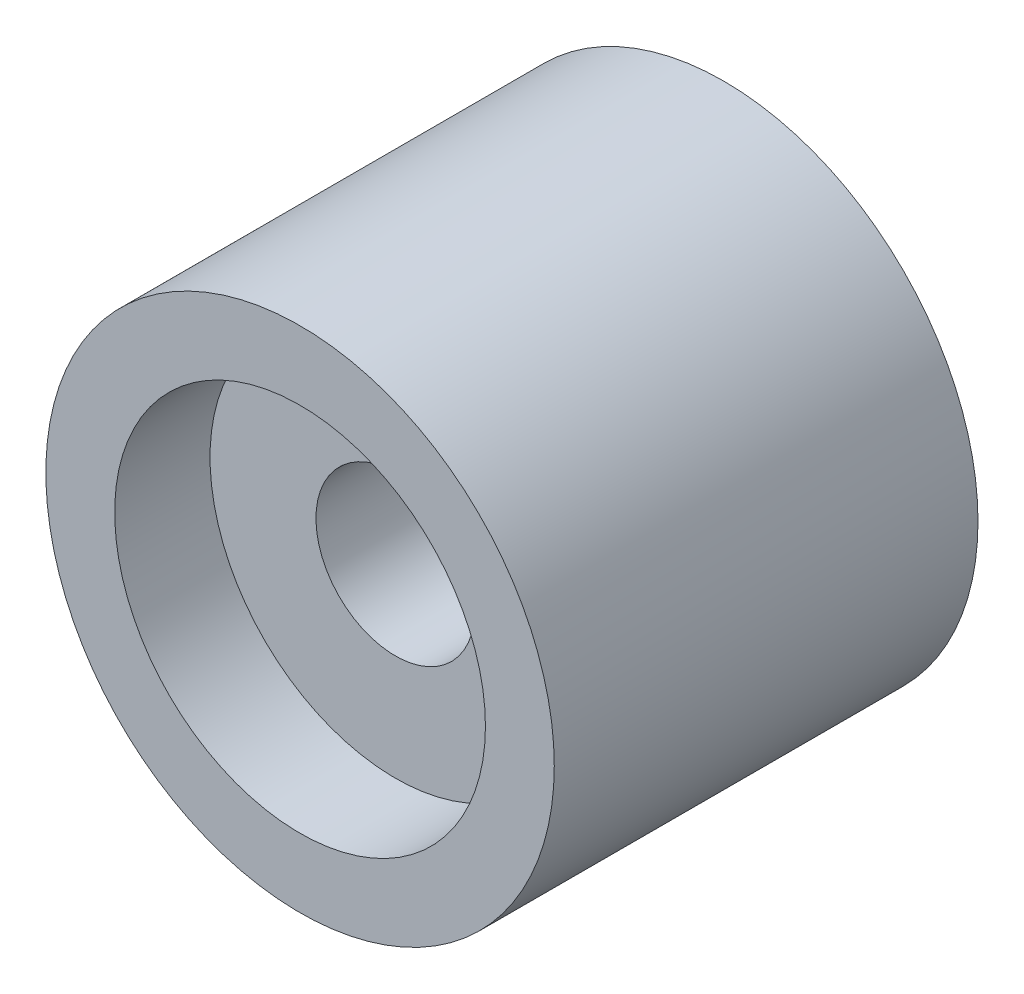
ISO-10303-21;
HEADER;
FILE_DESCRIPTION(('STEP AP214'),'2;1');
FILE_NAME('part.step','',(''),(''),'','','');
FILE_SCHEMA(('AUTOMOTIVE_DESIGN { 1 0 10303 214 1 1 1 1 }'));
ENDSEC;
DATA;
#1=APPLICATION_CONTEXT('core data for automotive mechanical design processes');
#2=APPLICATION_PROTOCOL_DEFINITION('international standard','automotive_design',2000,#1);
#3=PRODUCT_CONTEXT('',#1,'mechanical');
#4=PRODUCT('Part','Part','',(#3));
#5=PRODUCT_RELATED_PRODUCT_CATEGORY('part','',(#4));
#6=PRODUCT_DEFINITION_FORMATION('','',#4);
#7=PRODUCT_DEFINITION_CONTEXT('part definition',#1,'design');
#8=PRODUCT_DEFINITION('design','',#6,#7);
#9=PRODUCT_DEFINITION_SHAPE('','',#8);
#10=(LENGTH_UNIT() NAMED_UNIT(*) SI_UNIT(.MILLI.,.METRE.));
#11=(NAMED_UNIT(*) PLANE_ANGLE_UNIT() SI_UNIT($,.RADIAN.));
#12=(NAMED_UNIT(*) SI_UNIT($,.STERADIAN.) SOLID_ANGLE_UNIT());
#13=UNCERTAINTY_MEASURE_WITH_UNIT(LENGTH_MEASURE(1.E-05),#10,'distance_accuracy_value','');
#14=(GEOMETRIC_REPRESENTATION_CONTEXT(3) GLOBAL_UNCERTAINTY_ASSIGNED_CONTEXT((#13)) GLOBAL_UNIT_ASSIGNED_CONTEXT((#10,
#11,#12)) REPRESENTATION_CONTEXT('',''));
#15=CARTESIAN_POINT('',(0.,0.,0.));
#16=DIRECTION('',(0.,0.,1.));
#17=DIRECTION('',(1.,0.,0.));
#18=AXIS2_PLACEMENT_3D('',#15,#16,#17);
#19=CARTESIAN_POINT('',(0.,-14.999999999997,11.));
#20=DIRECTION('',(0.,0.,-1.));
#21=DIRECTION('',(0.,-1.,0.));
#22=AXIS2_PLACEMENT_3D('',#19,#20,#21);
#23=PLANE('',#22);
#24=CARTESIAN_POINT('',(0.,0.,11.));
#25=DIRECTION('',(0.,0.,1.));
#26=DIRECTION('',(0.,1.,0.));
#27=AXIS2_PLACEMENT_3D('',#24,#25,#26);
#28=CIRCLE('',#27,7.49999999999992);
#29=CARTESIAN_POINT('',(0.,7.49999999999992,11.));
#30=VERTEX_POINT('',#29);
#31=EDGE_CURVE('E8',#30,#30,#28,.T.);
#32=ORIENTED_EDGE('',*,*,#31,.F.);
#33=EDGE_LOOP('',(#32));
#34=FACE_BOUND('',#33,.T.);
#35=CARTESIAN_POINT('',(0.,0.,11.));
#36=DIRECTION('',(0.,0.,1.));
#37=DIRECTION('',(1.,0.,0.));
#38=AXIS2_PLACEMENT_3D('',#35,#36,#37);
#39=CIRCLE('',#38,17.499999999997);
#40=CARTESIAN_POINT('',(17.499999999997,0.,11.));
#41=VERTEX_POINT('',#40);
#42=EDGE_CURVE('E26',#41,#41,#39,.T.);
#43=ORIENTED_EDGE('',*,*,#42,.T.);
#44=EDGE_LOOP('',(#43));
#45=FACE_BOUND('',#44,.T.);
#46=ADVANCED_FACE('F12',(#34,#45),#23,.F.);
#47=CARTESIAN_POINT('',(0.,0.,22.));
#48=DIRECTION('',(0.,0.,1.));
#49=DIRECTION('',(0.,1.,0.));
#50=AXIS2_PLACEMENT_3D('',#47,#48,#49);
#51=CYLINDRICAL_SURFACE('',#50,7.49999999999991);
#52=CARTESIAN_POINT('',(0.,0.,-11.));
#53=DIRECTION('',(0.,0.,1.));
#54=DIRECTION('',(0.,1.,0.));
#55=AXIS2_PLACEMENT_3D('',#52,#53,#54);
#56=CIRCLE('',#55,7.4999999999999);
#57=CARTESIAN_POINT('',(0.,7.49999999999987,-11.));
#58=VERTEX_POINT('',#57);
#59=EDGE_CURVE('E18',#58,#58,#56,.T.);
#60=ORIENTED_EDGE('',*,*,#59,.F.);
#61=EDGE_LOOP('',(#60));
#62=FACE_BOUND('',#61,.T.);
#63=ORIENTED_EDGE('',*,*,#31,.T.);
#64=EDGE_LOOP('',(#63));
#65=FACE_BOUND('',#64,.T.);
#66=ADVANCED_FACE('F59',(#62,#65),#51,.F.);
#67=CARTESIAN_POINT('',(0.,-14.,-11.));
#68=DIRECTION('',(0.,0.,1.));
#69=DIRECTION('',(0.,1.,0.));
#70=AXIS2_PLACEMENT_3D('',#67,#68,#69);
#71=PLANE('',#70);
#72=CARTESIAN_POINT('',(0.,0.,-11.));
#73=DIRECTION('',(0.,0.,1.));
#74=DIRECTION('',(0.,1.,0.));
#75=AXIS2_PLACEMENT_3D('',#72,#73,#74);
#76=CIRCLE('',#75,14.);
#77=CARTESIAN_POINT('',(0.,14.,-11.));
#78=VERTEX_POINT('',#77);
#79=EDGE_CURVE('E22',#78,#78,#76,.T.);
#80=ORIENTED_EDGE('',*,*,#79,.F.);
#81=EDGE_LOOP('',(#80));
#82=FACE_BOUND('',#81,.T.);
#83=ORIENTED_EDGE('',*,*,#59,.T.);
#84=EDGE_LOOP('',(#83));
#85=FACE_BOUND('',#84,.T.);
#86=ADVANCED_FACE('F64',(#82,#85),#71,.F.);
#87=CARTESIAN_POINT('',(0.,0.,22.));
#88=DIRECTION('',(0.,0.,1.));
#89=DIRECTION('',(0.,1.,0.));
#90=AXIS2_PLACEMENT_3D('',#87,#88,#89);
#91=CYLINDRICAL_SURFACE('',#90,14.);
#92=ORIENTED_EDGE('',*,*,#79,.T.);
#93=EDGE_LOOP('',(#92));
#94=FACE_BOUND('',#93,.T.);
#95=CARTESIAN_POINT('',(0.,0.,-20.));
#96=DIRECTION('',(0.,0.,-1.));
#97=DIRECTION('',(0.,1.,0.));
#98=AXIS2_PLACEMENT_3D('',#95,#96,#97);
#99=CIRCLE('',#98,14.);
#100=CARTESIAN_POINT('',(0.,14.,-20.));
#101=VERTEX_POINT('',#100);
#102=EDGE_CURVE('E34',#101,#101,#99,.T.);
#103=ORIENTED_EDGE('',*,*,#102,.T.);
#104=EDGE_LOOP('',(#103));
#105=FACE_BOUND('',#104,.T.);
#106=ADVANCED_FACE('F70',(#94,#105),#91,.F.);
#107=CARTESIAN_POINT('',(0.,0.,22.));
#108=DIRECTION('',(0.,0.,1.));
#109=DIRECTION('',(0.,1.,0.));
#110=AXIS2_PLACEMENT_3D('',#107,#108,#109);
#111=CYLINDRICAL_SURFACE('',#110,17.499999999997);
#112=ORIENTED_EDGE('',*,*,#42,.F.);
#113=EDGE_LOOP('',(#112));
#114=FACE_BOUND('',#113,.T.);
#115=CARTESIAN_POINT('',(0.,0.,20.));
#116=DIRECTION('',(0.,0.,1.));
#117=DIRECTION('',(1.,0.,0.));
#118=AXIS2_PLACEMENT_3D('',#115,#116,#117);
#119=CIRCLE('',#118,17.499999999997);
#120=CARTESIAN_POINT('',(17.499999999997,0.,20.));
#121=VERTEX_POINT('',#120);
#122=EDGE_CURVE('E40',#121,#121,#119,.T.);
#123=ORIENTED_EDGE('',*,*,#122,.T.);
#124=EDGE_LOOP('',(#123));
#125=FACE_BOUND('',#124,.T.);
#126=ADVANCED_FACE('F44',(#114,#125),#111,.F.);
#127=CARTESIAN_POINT('',(0.,0.,-19.5));
#128=DIRECTION('',(0.,0.,1.));
#129=DIRECTION('',(1.,0.,0.));
#130=AXIS2_PLACEMENT_3D('',#127,#128,#129);
#131=CYLINDRICAL_SURFACE('',#130,24.);
#132=CARTESIAN_POINT('',(0.,0.,-20.));
#133=DIRECTION('',(0.,0.,-1.));
#134=DIRECTION('',(0.,1.,0.));
#135=AXIS2_PLACEMENT_3D('',#132,#133,#134);
#136=CIRCLE('',#135,24.);
#137=CARTESIAN_POINT('',(0.,24.,-20.));
#138=VERTEX_POINT('',#137);
#139=EDGE_CURVE('E31',#138,#138,#136,.T.);
#140=ORIENTED_EDGE('',*,*,#139,.F.);
#141=EDGE_LOOP('',(#140));
#142=FACE_BOUND('',#141,.T.);
#143=CARTESIAN_POINT('',(0.,0.,20.));
#144=DIRECTION('',(0.,0.,1.));
#145=DIRECTION('',(1.,0.,0.));
#146=AXIS2_PLACEMENT_3D('',#143,#144,#145);
#147=CIRCLE('',#146,24.);
#148=CARTESIAN_POINT('',(24.,0.,20.));
#149=VERTEX_POINT('',#148);
#150=EDGE_CURVE('E37',#149,#149,#147,.T.);
#151=ORIENTED_EDGE('',*,*,#150,.F.);
#152=EDGE_LOOP('',(#151));
#153=FACE_BOUND('',#152,.T.);
#154=ADVANCED_FACE('F55',(#142,#153),#131,.T.);
#155=CARTESIAN_POINT('',(0.,0.,-20.));
#156=DIRECTION('',(0.,0.,-1.));
#157=DIRECTION('',(0.,1.,0.));
#158=AXIS2_PLACEMENT_3D('',#155,#156,#157);
#159=PLANE('',#158);
#160=ORIENTED_EDGE('',*,*,#139,.T.);
#161=EDGE_LOOP('',(#160));
#162=FACE_BOUND('',#161,.T.);
#163=ORIENTED_EDGE('',*,*,#102,.F.);
#164=EDGE_LOOP('',(#163));
#165=FACE_BOUND('',#164,.T.);
#166=ADVANCED_FACE('F48',(#162,#165),#159,.T.);
#167=CARTESIAN_POINT('',(0.,0.,20.));
#168=DIRECTION('',(0.,0.,1.));
#169=DIRECTION('',(1.,0.,0.));
#170=AXIS2_PLACEMENT_3D('',#167,#168,#169);
#171=PLANE('',#170);
#172=ORIENTED_EDGE('',*,*,#150,.T.);
#173=EDGE_LOOP('',(#172));
#174=FACE_BOUND('',#173,.T.);
#175=ORIENTED_EDGE('',*,*,#122,.F.);
#176=EDGE_LOOP('',(#175));
#177=FACE_BOUND('',#176,.T.);
#178=ADVANCED_FACE('F46',(#174,#177),#171,.T.);
#179=CLOSED_SHELL('',(#46,#66,#86,#106,#126,#154,#166,#178));
#180=MANIFOLD_SOLID_BREP('B1',#179);
#181=ADVANCED_BREP_SHAPE_REPRESENTATION('',(#18,#180),#14);
#182=SHAPE_DEFINITION_REPRESENTATION(#9,#181);
ENDSEC;
END-ISO-10303-21;
